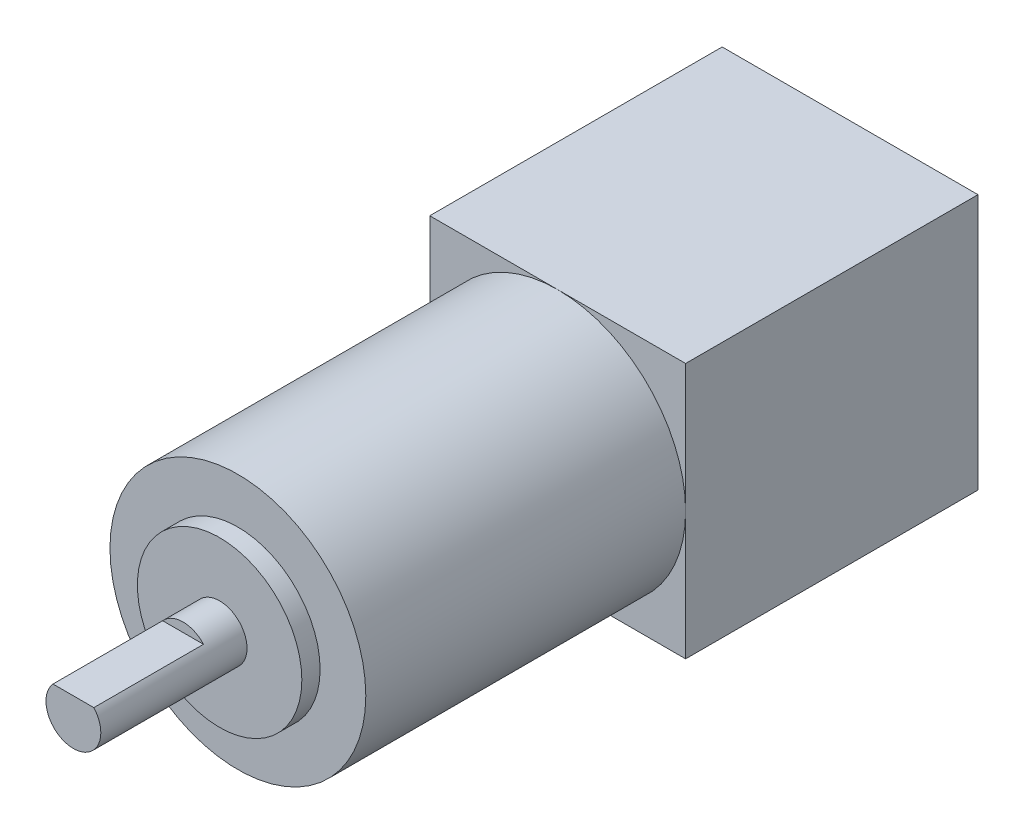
ISO-10303-21;
HEADER;
FILE_DESCRIPTION(('STEP AP214'),'2;1');
FILE_NAME('part.step','',(''),(''),'','','');
FILE_SCHEMA(('AUTOMOTIVE_DESIGN { 1 0 10303 214 1 1 1 1 }'));
ENDSEC;
DATA;
#1=APPLICATION_CONTEXT('core data for automotive mechanical design processes');
#2=APPLICATION_PROTOCOL_DEFINITION('international standard','automotive_design',2000,#1);
#3=PRODUCT_CONTEXT('',#1,'mechanical');
#4=PRODUCT('Part','Part','',(#3));
#5=PRODUCT_RELATED_PRODUCT_CATEGORY('part','',(#4));
#6=PRODUCT_DEFINITION_FORMATION('','',#4);
#7=PRODUCT_DEFINITION_CONTEXT('part definition',#1,'design');
#8=PRODUCT_DEFINITION('design','',#6,#7);
#9=PRODUCT_DEFINITION_SHAPE('','',#8);
#10=(LENGTH_UNIT() NAMED_UNIT(*) SI_UNIT(.MILLI.,.METRE.));
#11=(NAMED_UNIT(*) PLANE_ANGLE_UNIT() SI_UNIT($,.RADIAN.));
#12=(NAMED_UNIT(*) SI_UNIT($,.STERADIAN.) SOLID_ANGLE_UNIT());
#13=UNCERTAINTY_MEASURE_WITH_UNIT(LENGTH_MEASURE(1.E-05),#10,'distance_accuracy_value','');
#14=(GEOMETRIC_REPRESENTATION_CONTEXT(3) GLOBAL_UNCERTAINTY_ASSIGNED_CONTEXT((#13)) GLOBAL_UNIT_ASSIGNED_CONTEXT((#10,
#11,#12)) REPRESENTATION_CONTEXT('',''));
#15=CARTESIAN_POINT('',(0.,0.,0.));
#16=DIRECTION('',(0.,0.,1.));
#17=DIRECTION('',(1.,0.,0.));
#18=AXIS2_PLACEMENT_3D('',#15,#16,#17);
#19=CARTESIAN_POINT('',(0.,0.,85.));
#20=DIRECTION('',(0.,0.,-1.));
#21=DIRECTION('',(-1.,0.,0.));
#22=AXIS2_PLACEMENT_3D('',#19,#20,#21);
#23=CYLINDRICAL_SURFACE('',#22,3.);
#24=CARTESIAN_POINT('',(0.,0.,69.));
#25=DIRECTION('',(0.,0.,1.));
#26=DIRECTION('',(1.,0.,0.));
#27=AXIS2_PLACEMENT_3D('',#24,#25,#26);
#28=CIRCLE('',#27,3.);
#29=CARTESIAN_POINT('',(3.,0.,69.));
#30=VERTEX_POINT('',#29);
#31=EDGE_CURVE('E46',#30,#30,#28,.T.);
#32=ORIENTED_EDGE('',*,*,#31,.T.);
#33=EDGE_LOOP('',(#32));
#34=FACE_BOUND('',#33,.T.);
#35=CARTESIAN_POINT('',(0.,0.,73.));
#36=DIRECTION('',(0.,0.,1.));
#37=DIRECTION('',(1.,0.,0.));
#38=AXIS2_PLACEMENT_3D('',#35,#36,#37);
#39=CIRCLE('',#38,3.);
#40=CARTESIAN_POINT('',(2.23606797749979,2.,73.));
#41=VERTEX_POINT('',#40);
#42=CARTESIAN_POINT('',(-2.23606797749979,2.,73.));
#43=VERTEX_POINT('',#42);
#44=EDGE_CURVE('E12',#41,#43,#39,.T.);
#45=ORIENTED_EDGE('',*,*,#44,.F.);
#46=DIRECTION('',(0.,0.,1.));
#47=VECTOR('',#46,1.);
#48=CARTESIAN_POINT('',(2.23606797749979,2.,73.));
#49=LINE('',#48,#47);
#50=CARTESIAN_POINT('',(2.23606797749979,2.,85.));
#51=VERTEX_POINT('',#50);
#52=EDGE_CURVE('E101',#41,#51,#49,.T.);
#53=ORIENTED_EDGE('',*,*,#52,.T.);
#54=CARTESIAN_POINT('',(0.,0.,85.));
#55=DIRECTION('',(0.,0.,1.));
#56=DIRECTION('',(1.,0.,0.));
#57=AXIS2_PLACEMENT_3D('',#54,#55,#56);
#58=CIRCLE('',#57,3.);
#59=CARTESIAN_POINT('',(-2.23606797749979,2.,85.));
#60=VERTEX_POINT('',#59);
#61=EDGE_CURVE('E114',#60,#51,#58,.T.);
#62=ORIENTED_EDGE('',*,*,#61,.F.);
#63=DIRECTION('',(0.,0.,1.));
#64=VECTOR('',#63,1.);
#65=CARTESIAN_POINT('',(-2.23606797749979,2.,73.));
#66=LINE('',#65,#64);
#67=EDGE_CURVE('E53',#43,#60,#66,.T.);
#68=ORIENTED_EDGE('',*,*,#67,.F.);
#69=EDGE_LOOP('',(#45,#53,#62,#68));
#70=FACE_BOUND('',#69,.T.);
#71=ADVANCED_FACE('F38',(#34,#70),#23,.T.);
#72=CARTESIAN_POINT('',(0.,0.,85.));
#73=DIRECTION('',(0.,0.,1.));
#74=DIRECTION('',(1.,0.,0.));
#75=AXIS2_PLACEMENT_3D('',#72,#73,#74);
#76=PLANE('',#75);
#77=ORIENTED_EDGE('',*,*,#61,.T.);
#78=DIRECTION('',(-1.,0.,0.));
#79=VECTOR('',#78,1.);
#80=CARTESIAN_POINT('',(-2.23606797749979,2.,85.));
#81=LINE('',#80,#79);
#82=EDGE_CURVE('E105',#51,#60,#81,.T.);
#83=ORIENTED_EDGE('',*,*,#82,.T.);
#84=EDGE_LOOP('',(#77,#83));
#85=FACE_BOUND('',#84,.T.);
#86=ADVANCED_FACE('F215',(#85),#76,.T.);
#87=CARTESIAN_POINT('',(0.,0.,32.));
#88=DIRECTION('',(0.,0.,-1.));
#89=DIRECTION('',(-1.,0.,0.));
#90=AXIS2_PLACEMENT_3D('',#87,#88,#89);
#91=PLANE('',#90);
#92=CARTESIAN_POINT('',(0.,0.,32.));
#93=DIRECTION('',(0.,0.,1.));
#94=DIRECTION('',(1.,0.,0.));
#95=AXIS2_PLACEMENT_3D('',#92,#93,#94);
#96=CIRCLE('',#95,14.);
#97=CARTESIAN_POINT('',(14.,0.,32.));
#98=VERTEX_POINT('',#97);
#99=CARTESIAN_POINT('',(0.,14.,32.));
#100=VERTEX_POINT('',#99);
#101=EDGE_CURVE('E125',#98,#100,#96,.T.);
#102=ORIENTED_EDGE('',*,*,#101,.F.);
#103=DIRECTION('',(0.,1.,0.));
#104=VECTOR('',#103,1.);
#105=CARTESIAN_POINT('',(14.,-14.,32.));
#106=LINE('',#105,#104);
#107=CARTESIAN_POINT('',(14.,14.,32.));
#108=VERTEX_POINT('',#107);
#109=EDGE_CURVE('E138',#98,#108,#106,.T.);
#110=ORIENTED_EDGE('',*,*,#109,.T.);
#111=DIRECTION('',(-1.,0.,0.));
#112=VECTOR('',#111,1.);
#113=CARTESIAN_POINT('',(-14.,14.,32.));
#114=LINE('',#113,#112);
#115=EDGE_CURVE('E139',#108,#100,#114,.T.);
#116=ORIENTED_EDGE('',*,*,#115,.T.);
#117=EDGE_LOOP('',(#102,#110,#116));
#118=FACE_BOUND('',#117,.T.);
#119=ADVANCED_FACE('F184',(#118),#91,.F.);
#120=CARTESIAN_POINT('',(-14.,0.,32.));
#121=VERTEX_POINT('',#120);
#122=EDGE_CURVE('E128',#100,#121,#96,.T.);
#123=ORIENTED_EDGE('',*,*,#122,.F.);
#124=CARTESIAN_POINT('',(-14.,14.,32.));
#125=VERTEX_POINT('',#124);
#126=EDGE_CURVE('E137',#100,#125,#114,.T.);
#127=ORIENTED_EDGE('',*,*,#126,.T.);
#128=DIRECTION('',(0.,-1.,0.));
#129=VECTOR('',#128,1.);
#130=CARTESIAN_POINT('',(-14.,-14.,32.));
#131=LINE('',#130,#129);
#132=EDGE_CURVE('E143',#125,#121,#131,.T.);
#133=ORIENTED_EDGE('',*,*,#132,.T.);
#134=EDGE_LOOP('',(#123,#127,#133));
#135=FACE_BOUND('',#134,.T.);
#136=ADVANCED_FACE('F179',(#135),#91,.F.);
#137=CARTESIAN_POINT('',(0.,-14.,32.));
#138=VERTEX_POINT('',#137);
#139=EDGE_CURVE('E171',#121,#138,#96,.T.);
#140=ORIENTED_EDGE('',*,*,#139,.F.);
#141=CARTESIAN_POINT('',(-14.,-14.,32.));
#142=VERTEX_POINT('',#141);
#143=EDGE_CURVE('E142',#121,#142,#131,.T.);
#144=ORIENTED_EDGE('',*,*,#143,.T.);
#145=DIRECTION('',(1.,0.,0.));
#146=VECTOR('',#145,1.);
#147=CARTESIAN_POINT('',(-14.,-14.,32.));
#148=LINE('',#147,#146);
#149=EDGE_CURVE('E147',#142,#138,#148,.T.);
#150=ORIENTED_EDGE('',*,*,#149,.T.);
#151=EDGE_LOOP('',(#140,#144,#150));
#152=FACE_BOUND('',#151,.T.);
#153=ADVANCED_FACE('F200',(#152),#91,.F.);
#154=CARTESIAN_POINT('',(14.,-14.,32.));
#155=DIRECTION('',(-1.,0.,0.));
#156=DIRECTION('',(0.,0.,1.));
#157=AXIS2_PLACEMENT_3D('',#154,#155,#156);
#158=PLANE('',#157);
#159=DIRECTION('',(0.,1.,0.));
#160=VECTOR('',#159,1.);
#161=CARTESIAN_POINT('',(14.,-14.,0.));
#162=LINE('',#161,#160);
#163=CARTESIAN_POINT('',(14.,-14.,0.));
#164=VERTEX_POINT('',#163);
#165=CARTESIAN_POINT('',(14.,14.,0.));
#166=VERTEX_POINT('',#165);
#167=EDGE_CURVE('E132',#164,#166,#162,.T.);
#168=ORIENTED_EDGE('',*,*,#167,.T.);
#169=DIRECTION('',(0.,0.,-1.));
#170=VECTOR('',#169,1.);
#171=CARTESIAN_POINT('',(14.,14.,32.));
#172=LINE('',#171,#170);
#173=EDGE_CURVE('E166',#108,#166,#172,.T.);
#174=ORIENTED_EDGE('',*,*,#173,.F.);
#175=ORIENTED_EDGE('',*,*,#109,.F.);
#176=CARTESIAN_POINT('',(14.,-14.,32.));
#177=VERTEX_POINT('',#176);
#178=EDGE_CURVE('E135',#177,#98,#106,.T.);
#179=ORIENTED_EDGE('',*,*,#178,.F.);
#180=DIRECTION('',(0.,0.,-1.));
#181=VECTOR('',#180,1.);
#182=CARTESIAN_POINT('',(14.,-14.,32.));
#183=LINE('',#182,#181);
#184=EDGE_CURVE('E150',#177,#164,#183,.T.);
#185=ORIENTED_EDGE('',*,*,#184,.T.);
#186=EDGE_LOOP('',(#168,#174,#175,#179,#185));
#187=FACE_BOUND('',#186,.T.);
#188=ADVANCED_FACE('F40',(#187),#158,.F.);
#189=CARTESIAN_POINT('',(-14.,14.,32.));
#190=DIRECTION('',(0.,-1.,0.));
#191=DIRECTION('',(0.,0.,-1.));
#192=AXIS2_PLACEMENT_3D('',#189,#190,#191);
#193=PLANE('',#192);
#194=DIRECTION('',(-1.,0.,0.));
#195=VECTOR('',#194,1.);
#196=CARTESIAN_POINT('',(-14.,14.,0.));
#197=LINE('',#196,#195);
#198=CARTESIAN_POINT('',(-14.,14.,0.));
#199=VERTEX_POINT('',#198);
#200=EDGE_CURVE('E153',#166,#199,#197,.T.);
#201=ORIENTED_EDGE('',*,*,#200,.T.);
#202=DIRECTION('',(0.,0.,-1.));
#203=VECTOR('',#202,1.);
#204=CARTESIAN_POINT('',(-14.,14.,32.));
#205=LINE('',#204,#203);
#206=EDGE_CURVE('E164',#125,#199,#205,.T.);
#207=ORIENTED_EDGE('',*,*,#206,.F.);
#208=ORIENTED_EDGE('',*,*,#126,.F.);
#209=ORIENTED_EDGE('',*,*,#115,.F.);
#210=ORIENTED_EDGE('',*,*,#173,.T.);
#211=EDGE_LOOP('',(#201,#207,#208,#209,#210));
#212=FACE_BOUND('',#211,.T.);
#213=ADVANCED_FACE('F182',(#212),#193,.F.);
#214=CARTESIAN_POINT('',(-14.,-14.,32.));
#215=DIRECTION('',(1.,0.,0.));
#216=DIRECTION('',(0.,0.,-1.));
#217=AXIS2_PLACEMENT_3D('',#214,#215,#216);
#218=PLANE('',#217);
#219=DIRECTION('',(0.,-1.,0.));
#220=VECTOR('',#219,1.);
#221=CARTESIAN_POINT('',(-14.,-14.,0.));
#222=LINE('',#221,#220);
#223=CARTESIAN_POINT('',(-14.,-14.,0.));
#224=VERTEX_POINT('',#223);
#225=EDGE_CURVE('E155',#199,#224,#222,.T.);
#226=ORIENTED_EDGE('',*,*,#225,.T.);
#227=DIRECTION('',(0.,0.,-1.));
#228=VECTOR('',#227,1.);
#229=CARTESIAN_POINT('',(-14.,-14.,32.));
#230=LINE('',#229,#228);
#231=EDGE_CURVE('E161',#142,#224,#230,.T.);
#232=ORIENTED_EDGE('',*,*,#231,.F.);
#233=ORIENTED_EDGE('',*,*,#143,.F.);
#234=ORIENTED_EDGE('',*,*,#132,.F.);
#235=ORIENTED_EDGE('',*,*,#206,.T.);
#236=EDGE_LOOP('',(#226,#232,#233,#234,#235));
#237=FACE_BOUND('',#236,.T.);
#238=ADVANCED_FACE('F195',(#237),#218,.F.);
#239=CARTESIAN_POINT('',(-14.,-14.,32.));
#240=DIRECTION('',(0.,1.,0.));
#241=DIRECTION('',(0.,0.,1.));
#242=AXIS2_PLACEMENT_3D('',#239,#240,#241);
#243=PLANE('',#242);
#244=DIRECTION('',(1.,0.,0.));
#245=VECTOR('',#244,1.);
#246=CARTESIAN_POINT('',(-14.,-14.,0.));
#247=LINE('',#246,#245);
#248=EDGE_CURVE('E157',#224,#164,#247,.T.);
#249=ORIENTED_EDGE('',*,*,#248,.T.);
#250=ORIENTED_EDGE('',*,*,#184,.F.);
#251=EDGE_CURVE('E146',#138,#177,#148,.T.);
#252=ORIENTED_EDGE('',*,*,#251,.F.);
#253=ORIENTED_EDGE('',*,*,#149,.F.);
#254=ORIENTED_EDGE('',*,*,#231,.T.);
#255=EDGE_LOOP('',(#249,#250,#252,#253,#254));
#256=FACE_BOUND('',#255,.T.);
#257=ADVANCED_FACE('F202',(#256),#243,.F.);
#258=EDGE_CURVE('E61',#138,#98,#96,.T.);
#259=ORIENTED_EDGE('',*,*,#258,.F.);
#260=ORIENTED_EDGE('',*,*,#251,.T.);
#261=ORIENTED_EDGE('',*,*,#178,.T.);
#262=EDGE_LOOP('',(#259,#260,#261));
#263=FACE_BOUND('',#262,.T.);
#264=ADVANCED_FACE('F203',(#263),#91,.F.);
#265=CARTESIAN_POINT('',(0.,0.,0.));
#266=DIRECTION('',(0.,0.,-1.));
#267=DIRECTION('',(-1.,0.,0.));
#268=AXIS2_PLACEMENT_3D('',#265,#266,#267);
#269=PLANE('',#268);
#270=CARTESIAN_POINT('',(0.,0.,0.));
#271=DIRECTION('',(0.,0.,-1.));
#272=DIRECTION('',(-1.,0.,0.));
#273=AXIS2_PLACEMENT_3D('',#270,#271,#272);
#274=CIRCLE('',#273,2.5);
#275=CARTESIAN_POINT('',(-2.5,0.,0.));
#276=VERTEX_POINT('',#275);
#277=EDGE_CURVE('E371',#276,#276,#274,.T.);
#278=ORIENTED_EDGE('',*,*,#277,.F.);
#279=EDGE_LOOP('',(#278));
#280=FACE_BOUND('',#279,.T.);
#281=ORIENTED_EDGE('',*,*,#167,.F.);
#282=ORIENTED_EDGE('',*,*,#248,.F.);
#283=ORIENTED_EDGE('',*,*,#225,.F.);
#284=ORIENTED_EDGE('',*,*,#200,.F.);
#285=EDGE_LOOP('',(#281,#282,#283,#284));
#286=FACE_BOUND('',#285,.T.);
#287=ADVANCED_FACE('F192',(#280,#286),#269,.T.);
#288=CARTESIAN_POINT('',(0.,0.,67.));
#289=DIRECTION('',(0.,0.,-1.));
#290=DIRECTION('',(-1.,0.,0.));
#291=AXIS2_PLACEMENT_3D('',#288,#289,#290);
#292=CYLINDRICAL_SURFACE('',#291,14.);
#293=CARTESIAN_POINT('',(0.,0.,67.));
#294=DIRECTION('',(0.,0.,1.));
#295=DIRECTION('',(1.,0.,0.));
#296=AXIS2_PLACEMENT_3D('',#293,#294,#295);
#297=CIRCLE('',#296,14.);
#298=CARTESIAN_POINT('',(14.,0.,67.));
#299=VERTEX_POINT('',#298);
#300=EDGE_CURVE('E129',#299,#299,#297,.T.);
#301=ORIENTED_EDGE('',*,*,#300,.F.);
#302=EDGE_LOOP('',(#301));
#303=FACE_BOUND('',#302,.T.);
#304=ORIENTED_EDGE('',*,*,#101,.T.);
#305=ORIENTED_EDGE('',*,*,#122,.T.);
#306=ORIENTED_EDGE('',*,*,#139,.T.);
#307=ORIENTED_EDGE('',*,*,#258,.T.);
#308=EDGE_LOOP('',(#304,#305,#306,#307));
#309=FACE_BOUND('',#308,.T.);
#310=ADVANCED_FACE('F175',(#303,#309),#292,.T.);
#311=CARTESIAN_POINT('',(0.,0.,67.));
#312=DIRECTION('',(0.,0.,1.));
#313=DIRECTION('',(1.,0.,0.));
#314=AXIS2_PLACEMENT_3D('',#311,#312,#313);
#315=PLANE('',#314);
#316=CARTESIAN_POINT('',(0.,0.,67.));
#317=DIRECTION('',(0.,0.,1.));
#318=DIRECTION('',(1.,0.,0.));
#319=AXIS2_PLACEMENT_3D('',#316,#317,#318);
#320=CIRCLE('',#319,9.);
#321=CARTESIAN_POINT('',(9.,0.,67.));
#322=VERTEX_POINT('',#321);
#323=EDGE_CURVE('E122',#322,#322,#320,.T.);
#324=ORIENTED_EDGE('',*,*,#323,.F.);
#325=EDGE_LOOP('',(#324));
#326=FACE_BOUND('',#325,.T.);
#327=ORIENTED_EDGE('',*,*,#300,.T.);
#328=EDGE_LOOP('',(#327));
#329=FACE_BOUND('',#328,.T.);
#330=ADVANCED_FACE('F234',(#326,#329),#315,.T.);
#331=CARTESIAN_POINT('',(0.,0.,69.));
#332=DIRECTION('',(0.,0.,-1.));
#333=DIRECTION('',(-1.,0.,0.));
#334=AXIS2_PLACEMENT_3D('',#331,#332,#333);
#335=CYLINDRICAL_SURFACE('',#334,9.);
#336=CARTESIAN_POINT('',(0.,0.,69.));
#337=DIRECTION('',(0.,0.,1.));
#338=DIRECTION('',(1.,0.,0.));
#339=AXIS2_PLACEMENT_3D('',#336,#337,#338);
#340=CIRCLE('',#339,9.);
#341=CARTESIAN_POINT('',(9.,0.,69.));
#342=VERTEX_POINT('',#341);
#343=EDGE_CURVE('E116',#342,#342,#340,.T.);
#344=ORIENTED_EDGE('',*,*,#343,.F.);
#345=EDGE_LOOP('',(#344));
#346=FACE_BOUND('',#345,.T.);
#347=ORIENTED_EDGE('',*,*,#323,.T.);
#348=EDGE_LOOP('',(#347));
#349=FACE_BOUND('',#348,.T.);
#350=ADVANCED_FACE('F230',(#346,#349),#335,.T.);
#351=CARTESIAN_POINT('',(0.,0.,69.));
#352=DIRECTION('',(0.,0.,1.));
#353=DIRECTION('',(1.,0.,0.));
#354=AXIS2_PLACEMENT_3D('',#351,#352,#353);
#355=PLANE('',#354);
#356=ORIENTED_EDGE('',*,*,#31,.F.);
#357=EDGE_LOOP('',(#356));
#358=FACE_BOUND('',#357,.T.);
#359=ORIENTED_EDGE('',*,*,#343,.T.);
#360=EDGE_LOOP('',(#359));
#361=FACE_BOUND('',#360,.T.);
#362=ADVANCED_FACE('F227',(#358,#361),#355,.T.);
#363=CARTESIAN_POINT('',(0.,0.,73.));
#364=DIRECTION('',(0.,0.,1.));
#365=DIRECTION('',(1.,0.,0.));
#366=AXIS2_PLACEMENT_3D('',#363,#364,#365);
#367=PLANE('',#366);
#368=ORIENTED_EDGE('',*,*,#44,.T.);
#369=DIRECTION('',(-1.,0.,0.));
#370=VECTOR('',#369,1.);
#371=CARTESIAN_POINT('',(-2.23606797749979,2.,73.));
#372=LINE('',#371,#370);
#373=EDGE_CURVE('E104',#41,#43,#372,.T.);
#374=ORIENTED_EDGE('',*,*,#373,.F.);
#375=EDGE_LOOP('',(#368,#374));
#376=FACE_BOUND('',#375,.T.);
#377=ADVANCED_FACE('F112',(#376),#367,.T.);
#378=CARTESIAN_POINT('',(-2.23606797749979,2.,73.));
#379=DIRECTION('',(0.,1.,0.));
#380=DIRECTION('',(0.,0.,1.));
#381=AXIS2_PLACEMENT_3D('',#378,#379,#380);
#382=PLANE('',#381);
#383=ORIENTED_EDGE('',*,*,#82,.F.);
#384=ORIENTED_EDGE('',*,*,#52,.F.);
#385=ORIENTED_EDGE('',*,*,#373,.T.);
#386=ORIENTED_EDGE('',*,*,#67,.T.);
#387=EDGE_LOOP('',(#383,#384,#385,#386));
#388=FACE_BOUND('',#387,.T.);
#389=ADVANCED_FACE('F103',(#388),#382,.T.);
#390=CARTESIAN_POINT('',(0.,0.,-10.));
#391=DIRECTION('',(0.,0.,1.));
#392=DIRECTION('',(1.,0.,0.));
#393=AXIS2_PLACEMENT_3D('',#390,#391,#392);
#394=CYLINDRICAL_SURFACE('',#393,2.5);
#395=CARTESIAN_POINT('',(0.,0.,-10.));
#396=DIRECTION('',(0.,0.,-1.));
#397=DIRECTION('',(-1.,0.,0.));
#398=AXIS2_PLACEMENT_3D('',#395,#396,#397);
#399=CIRCLE('',#398,2.5);
#400=CARTESIAN_POINT('',(-2.5,0.,-10.));
#401=VERTEX_POINT('',#400);
#402=EDGE_CURVE('E370',#401,#401,#399,.T.);
#403=ORIENTED_EDGE('',*,*,#402,.F.);
#404=EDGE_LOOP('',(#403));
#405=FACE_BOUND('',#404,.T.);
#406=ORIENTED_EDGE('',*,*,#277,.T.);
#407=EDGE_LOOP('',(#406));
#408=FACE_BOUND('',#407,.T.);
#409=ADVANCED_FACE('F270',(#405,#408),#394,.T.);
#410=CARTESIAN_POINT('',(0.,0.,-10.));
#411=DIRECTION('',(0.,0.,-1.));
#412=DIRECTION('',(-1.,0.,0.));
#413=AXIS2_PLACEMENT_3D('',#410,#411,#412);
#414=PLANE('',#413);
#415=ORIENTED_EDGE('',*,*,#402,.T.);
#416=EDGE_LOOP('',(#415));
#417=FACE_BOUND('',#416,.T.);
#418=ADVANCED_FACE('F277',(#417),#414,.T.);
#419=CLOSED_SHELL('',(#71,#86,#119,#136,#153,#188,#213,#238,#257,#264,#287,#310,#330,#350,#362,
#377,#389,#409,#418));
#420=MANIFOLD_SOLID_BREP('B2',#419);
#421=ADVANCED_BREP_SHAPE_REPRESENTATION('',(#18,#420),#14);
#422=SHAPE_DEFINITION_REPRESENTATION(#9,#421);
ENDSEC;
END-ISO-10303-21;
